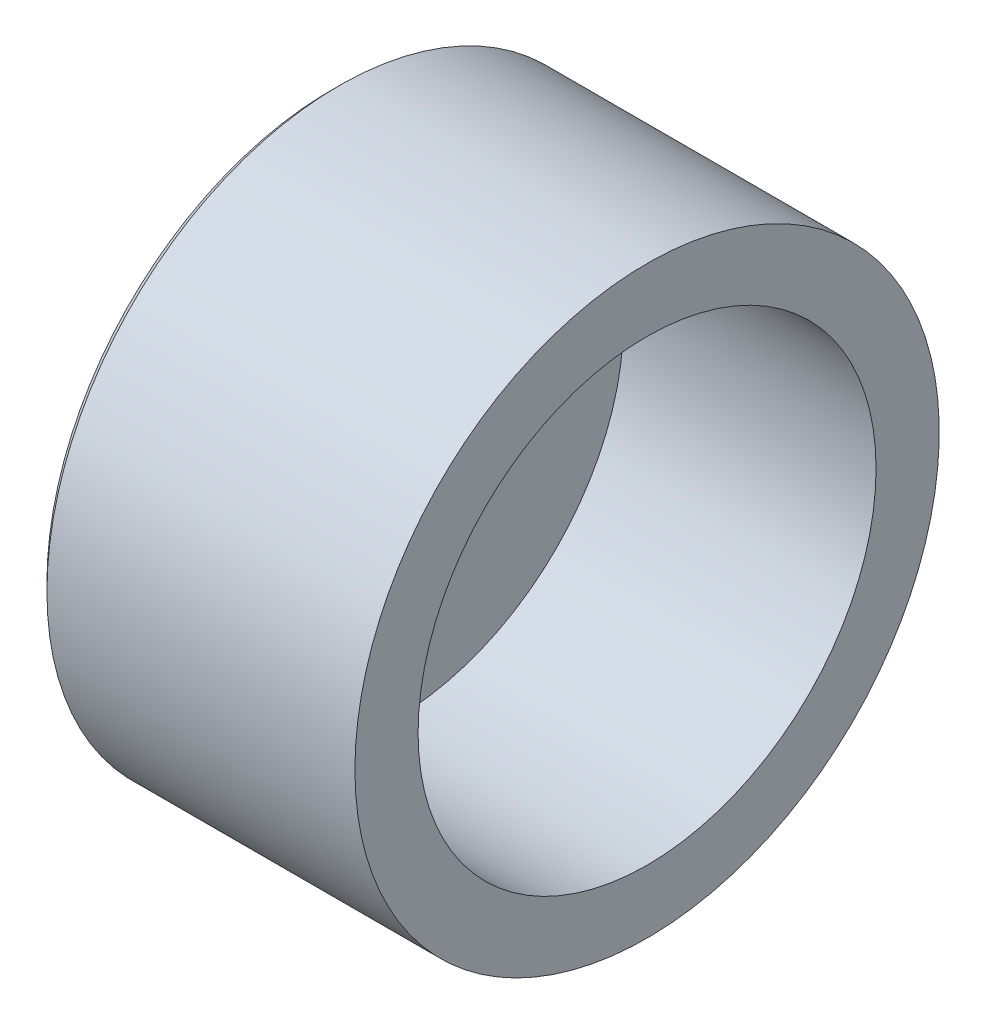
from build123d import *


with BuildPart() as part:
    # Esquisse1 → R_volution1 (revolve)
    with BuildSketch(Plane.XY, mode=Mode.PRIVATE) as r_volution1_sk:
        Polygon((0, 5.25), (0, 18), (0.5, 18.5), (16, 18.5), (20, 18.5), (20, 14.5), (4, 14.5), (4, 5.25), align=None)
    revolve(r_volution1_sk.sketch.rotate(Axis((0, 0, 0), (1, 0, 0)), 90), axis=Axis((0, 0, 0), (1, 0, 0)))


solid = part.part
